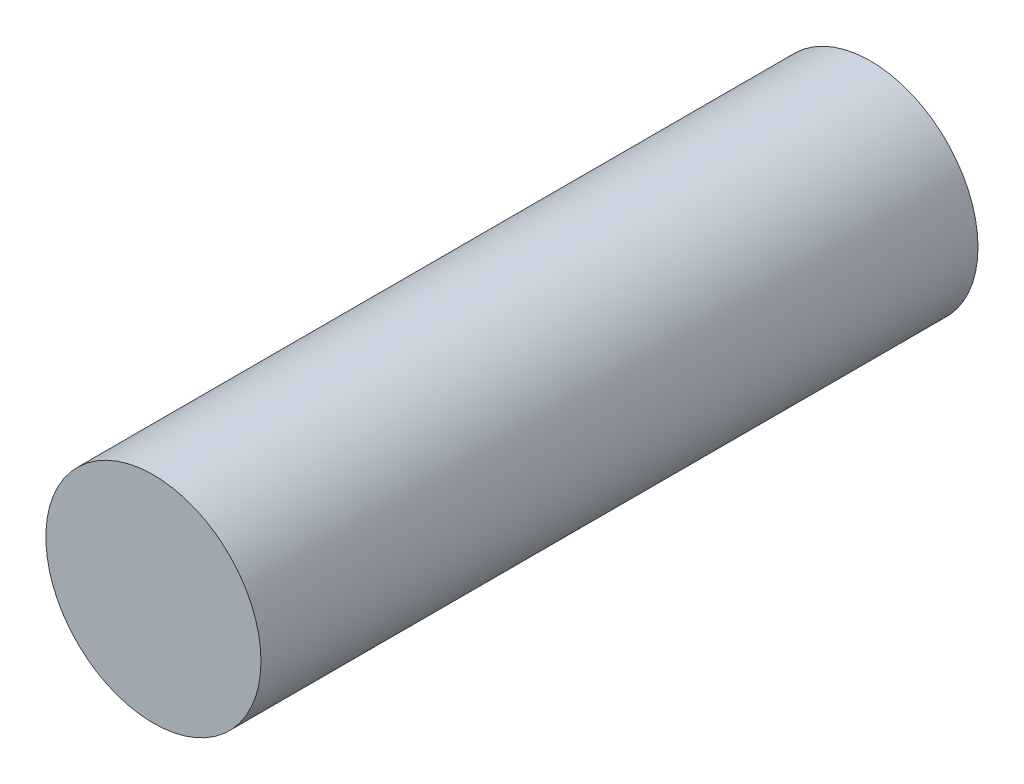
from build123d import *

# Parameters (mm, degrees)
ESQUISSE1_R        = 1500
BOSS_EXTRU_1_DEPTH = 5000


with BuildPart() as part:
    # Esquisse1 → Boss.-Extru.1 (new, symmetric)
    with BuildSketch(Plane.XY):
        Circle(ESQUISSE1_R)
    extrude(amount=BOSS_EXTRU_1_DEPTH, both=True)


solid = part.part
